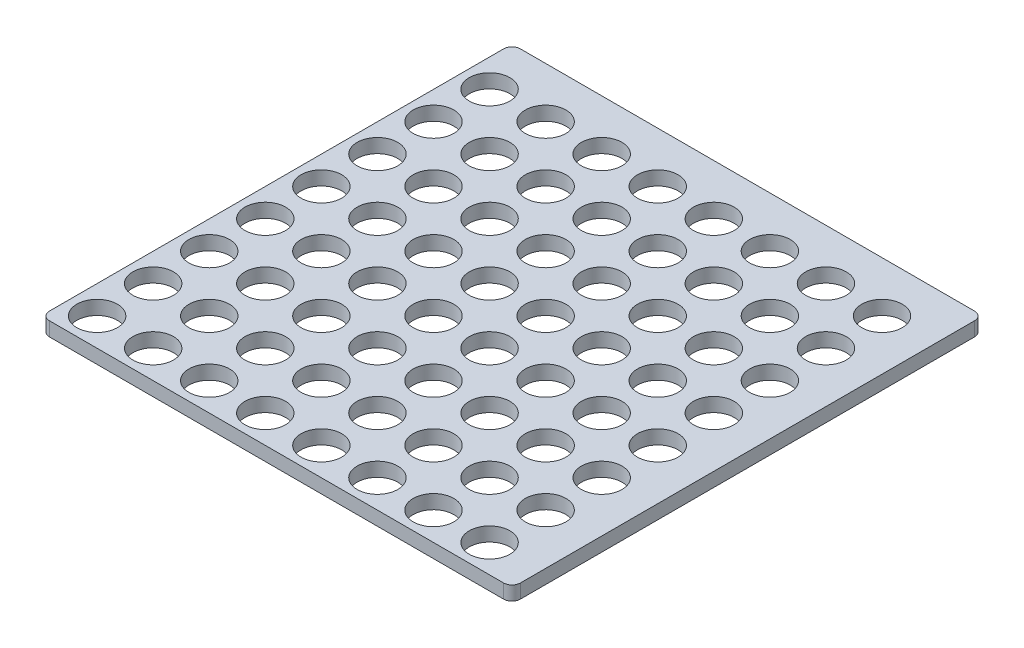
from build123d import *

# Parameters (mm, degrees)
SKETCH1_W              = 168
SKETCH1_H              = 168
BOSS_EXTRUDE1_DEPTH    = 5
FILLET1_R              = 3
M16X1_5_TAPPED_HOLE1_D = 14.5
LPATTERN1_COUNT        = 8
LPATTERN1_PITCH        = 20
LPATTERN2_COUNT        = 8
LPATTERN2_PITCH        = 20
LPATTERN2_COPY_1_D     = 14.5
LPATTERN2_COPY_2_D     = 14.5
LPATTERN2_COPY_3_D     = 14.5
LPATTERN2_COPY_4_D     = 14.5
LPATTERN2_COPY_5_D     = 14.5
LPATTERN2_COPY_6_D     = 14.5
LPATTERN2_COPY_7_D     = 14.5
LPATTERN2_COPY_8_D     = 14.5
LPATTERN2_COPY_9_D     = 14.5
LPATTERN2_COPY_10_D    = 14.5
LPATTERN2_COPY_11_D    = 14.5
LPATTERN2_COPY_12_D    = 14.5
LPATTERN2_COPY_13_D    = 14.5
LPATTERN2_COPY_14_D    = 14.5
LPATTERN2_COPY_15_D    = 14.5
LPATTERN2_COPY_16_D    = 14.5
LPATTERN2_COPY_17_D    = 14.5
LPATTERN2_COPY_18_D    = 14.5
LPATTERN2_COPY_19_D    = 14.5
LPATTERN2_COPY_20_D    = 14.5
LPATTERN2_COPY_21_D    = 14.5
LPATTERN2_COPY_22_D    = 14.5
LPATTERN2_COPY_23_D    = 14.5
LPATTERN2_COPY_24_D    = 14.5
LPATTERN2_COPY_25_D    = 14.5
LPATTERN2_COPY_26_D    = 14.5
LPATTERN2_COPY_27_D    = 14.5
LPATTERN2_COPY_28_D    = 14.5
LPATTERN2_COPY_29_D    = 14.5
LPATTERN2_COPY_30_D    = 14.5
LPATTERN2_COPY_31_D    = 14.5
LPATTERN2_COPY_32_D    = 14.5
LPATTERN2_COPY_33_D    = 14.5
LPATTERN2_COPY_34_D    = 14.5
LPATTERN2_COPY_35_D    = 14.5
LPATTERN2_COPY_36_D    = 14.5
LPATTERN2_COPY_37_D    = 14.5
LPATTERN2_COPY_38_D    = 14.5
LPATTERN2_COPY_39_D    = 14.5
LPATTERN2_COPY_40_D    = 14.5
LPATTERN2_COPY_41_D    = 14.5
LPATTERN2_COPY_42_D    = 14.5
LPATTERN2_COPY_43_D    = 14.5
LPATTERN2_COPY_44_D    = 14.5
LPATTERN2_COPY_45_D    = 14.5
LPATTERN2_COPY_46_D    = 14.5
LPATTERN2_COPY_47_D    = 14.5
LPATTERN2_COPY_48_D    = 14.5
LPATTERN2_COPY_49_D    = 14.5


with BuildPart() as part:
    # Sketch1 → Boss-Extrude1 (new body)
    with BuildSketch(Plane(origin=(0, 0, 0), x_dir=(1, 0, 0), z_dir=(0, 1, 0))):
        Rectangle(SKETCH1_W, SKETCH1_H)
    extrude(amount=BOSS_EXTRUDE1_DEPTH)

    # Fillet1
    fillet1_edges = [part.edges().sort_by_distance(p)[0] for p in [
        (84, 2.5, 84),
        (-84, 2.5, 84),
        (-84, 2.5, -84),
        (84, 2.5, -84),
    ]]
    fillet(fillet1_edges, radius=FILLET1_R)

    # M16x1.5 Tapped Hole1 (through all)
    with Locations(Plane(origin=(-74, 0, -65.997503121), x_dir=(0, 0, -1), z_dir=(0, -1, 0))):
        with Locations((0, 0)):
            m16x1_5_tapped_hole1 = Hole(M16X1_5_TAPPED_HOLE1_D / 2)

    # LPattern1: M16x1.5 Tapped Hole1 ×8
    with Locations(*[(i * LPATTERN1_PITCH, 0, 0) for i in range(1, LPATTERN1_COUNT)]):
        add(m16x1_5_tapped_hole1, mode=Mode.SUBTRACT)

    # LPattern2: M16x1.5 Tapped Hole1 ×8
    with Locations(*[(0, 0, i * LPATTERN2_PITCH) for i in range(1, LPATTERN2_COUNT)]):
        add(m16x1_5_tapped_hole1, mode=Mode.SUBTRACT)

    # LPattern2 copy 1 (through all)
    with Locations(Plane(origin=(-54, 0, -45.997503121), x_dir=(0, 0, -1), z_dir=(0, -1, 0))):
        with Locations((0, 0)):
            Hole(LPATTERN2_COPY_1_D / 2)

    # LPattern2 copy 2 (through all)
    with Locations(Plane(origin=(-54, 0, -25.997503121), x_dir=(0, 0, -1), z_dir=(0, -1, 0))):
        with Locations((0, 0)):
            Hole(LPATTERN2_COPY_2_D / 2)

    # LPattern2 copy 3 (through all)
    with Locations(Plane(origin=(-54, 0, -5.997503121), x_dir=(0, 0, -1), z_dir=(0, -1, 0))):
        with Locations((0, 0)):
            Hole(LPATTERN2_COPY_3_D / 2)

    # LPattern2 copy 4 (through all)
    with Locations(Plane(origin=(-54, 0, 14.002496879), x_dir=(0, 0, -1), z_dir=(0, -1, 0))):
        with Locations((0, 0)):
            Hole(LPATTERN2_COPY_4_D / 2)

    # LPattern2 copy 5 (through all)
    with Locations(Plane(origin=(-54, 0, 34.002496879), x_dir=(0, 0, -1), z_dir=(0, -1, 0))):
        with Locations((0, 0)):
            Hole(LPATTERN2_COPY_5_D / 2)

    # LPattern2 copy 6 (through all)
    with Locations(Plane(origin=(-54, 0, 54.002496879), x_dir=(0, 0, -1), z_dir=(0, -1, 0))):
        with Locations((0, 0)):
            Hole(LPATTERN2_COPY_6_D / 2)

    # LPattern2 copy 7 (through all)
    with Locations(Plane(origin=(-54, 0, 74.002496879), x_dir=(0, 0, -1), z_dir=(0, -1, 0))):
        with Locations((0, 0)):
            Hole(LPATTERN2_COPY_7_D / 2)

    # LPattern2 copy 8 (through all)
    with Locations(Plane(origin=(-34, 0, -45.997503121), x_dir=(0, 0, -1), z_dir=(0, -1, 0))):
        with Locations((0, 0)):
            Hole(LPATTERN2_COPY_8_D / 2)

    # LPattern2 copy 9 (through all)
    with Locations(Plane(origin=(-34, 0, -25.997503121), x_dir=(0, 0, -1), z_dir=(0, -1, 0))):
        with Locations((0, 0)):
            Hole(LPATTERN2_COPY_9_D / 2)

    # LPattern2 copy 10 (through all)
    with Locations(Plane(origin=(-34, 0, -5.997503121), x_dir=(0, 0, -1), z_dir=(0, -1, 0))):
        with Locations((0, 0)):
            Hole(LPATTERN2_COPY_10_D / 2)

    # LPattern2 copy 11 (through all)
    with Locations(Plane(origin=(-34, 0, 14.002496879), x_dir=(0, 0, -1), z_dir=(0, -1, 0))):
        with Locations((0, 0)):
            Hole(LPATTERN2_COPY_11_D / 2)

    # LPattern2 copy 12 (through all)
    with Locations(Plane(origin=(-34, 0, 34.002496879), x_dir=(0, 0, -1), z_dir=(0, -1, 0))):
        with Locations((0, 0)):
            Hole(LPATTERN2_COPY_12_D / 2)

    # LPattern2 copy 13 (through all)
    with Locations(Plane(origin=(-34, 0, 54.002496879), x_dir=(0, 0, -1), z_dir=(0, -1, 0))):
        with Locations((0, 0)):
            Hole(LPATTERN2_COPY_13_D / 2)

    # LPattern2 copy 14 (through all)
    with Locations(Plane(origin=(-34, 0, 74.002496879), x_dir=(0, 0, -1), z_dir=(0, -1, 0))):
        with Locations((0, 0)):
            Hole(LPATTERN2_COPY_14_D / 2)

    # LPattern2 copy 15 (through all)
    with Locations(Plane(origin=(-14, 0, -45.997503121), x_dir=(0, 0, -1), z_dir=(0, -1, 0))):
        with Locations((0, 0)):
            Hole(LPATTERN2_COPY_15_D / 2)

    # LPattern2 copy 16 (through all)
    with Locations(Plane(origin=(-14, 0, -25.997503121), x_dir=(0, 0, -1), z_dir=(0, -1, 0))):
        with Locations((0, 0)):
            Hole(LPATTERN2_COPY_16_D / 2)

    # LPattern2 copy 17 (through all)
    with Locations(Plane(origin=(-14, 0, -5.997503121), x_dir=(0, 0, -1), z_dir=(0, -1, 0))):
        with Locations((0, 0)):
            Hole(LPATTERN2_COPY_17_D / 2)

    # LPattern2 copy 18 (through all)
    with Locations(Plane(origin=(-14, 0, 14.002496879), x_dir=(0, 0, -1), z_dir=(0, -1, 0))):
        with Locations((0, 0)):
            Hole(LPATTERN2_COPY_18_D / 2)

    # LPattern2 copy 19 (through all)
    with Locations(Plane(origin=(-14, 0, 34.002496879), x_dir=(0, 0, -1), z_dir=(0, -1, 0))):
        with Locations((0, 0)):
            Hole(LPATTERN2_COPY_19_D / 2)

    # LPattern2 copy 20 (through all)
    with Locations(Plane(origin=(-14, 0, 54.002496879), x_dir=(0, 0, -1), z_dir=(0, -1, 0))):
        with Locations((0, 0)):
            Hole(LPATTERN2_COPY_20_D / 2)

    # LPattern2 copy 21 (through all)
    with Locations(Plane(origin=(-14, 0, 74.002496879), x_dir=(0, 0, -1), z_dir=(0, -1, 0))):
        with Locations((0, 0)):
            Hole(LPATTERN2_COPY_21_D / 2)

    # LPattern2 copy 22 (through all)
    with Locations(Plane(origin=(6, 0, -45.997503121), x_dir=(0, 0, -1), z_dir=(0, -1, 0))):
        with Locations((0, 0)):
            Hole(LPATTERN2_COPY_22_D / 2)

    # LPattern2 copy 23 (through all)
    with Locations(Plane(origin=(6, 0, -25.997503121), x_dir=(0, 0, -1), z_dir=(0, -1, 0))):
        with Locations((0, 0)):
            Hole(LPATTERN2_COPY_23_D / 2)

    # LPattern2 copy 24 (through all)
    with Locations(Plane(origin=(6, 0, -5.997503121), x_dir=(0, 0, -1), z_dir=(0, -1, 0))):
        with Locations((0, 0)):
            Hole(LPATTERN2_COPY_24_D / 2)

    # LPattern2 copy 25 (through all)
    with Locations(Plane(origin=(6, 0, 14.002496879), x_dir=(0, 0, -1), z_dir=(0, -1, 0))):
        with Locations((0, 0)):
            Hole(LPATTERN2_COPY_25_D / 2)

    # LPattern2 copy 26 (through all)
    with Locations(Plane(origin=(6, 0, 34.002496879), x_dir=(0, 0, -1), z_dir=(0, -1, 0))):
        with Locations((0, 0)):
            Hole(LPATTERN2_COPY_26_D / 2)

    # LPattern2 copy 27 (through all)
    with Locations(Plane(origin=(6, 0, 54.002496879), x_dir=(0, 0, -1), z_dir=(0, -1, 0))):
        with Locations((0, 0)):
            Hole(LPATTERN2_COPY_27_D / 2)

    # LPattern2 copy 28 (through all)
    with Locations(Plane(origin=(6, 0, 74.002496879), x_dir=(0, 0, -1), z_dir=(0, -1, 0))):
        with Locations((0, 0)):
            Hole(LPATTERN2_COPY_28_D / 2)

    # LPattern2 copy 29 (through all)
    with Locations(Plane(origin=(26, 0, -45.997503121), x_dir=(0, 0, -1), z_dir=(0, -1, 0))):
        with Locations((0, 0)):
            Hole(LPATTERN2_COPY_29_D / 2)

    # LPattern2 copy 30 (through all)
    with Locations(Plane(origin=(26, 0, -25.997503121), x_dir=(0, 0, -1), z_dir=(0, -1, 0))):
        with Locations((0, 0)):
            Hole(LPATTERN2_COPY_30_D / 2)

    # LPattern2 copy 31 (through all)
    with Locations(Plane(origin=(26, 0, -5.997503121), x_dir=(0, 0, -1), z_dir=(0, -1, 0))):
        with Locations((0, 0)):
            Hole(LPATTERN2_COPY_31_D / 2)

    # LPattern2 copy 32 (through all)
    with Locations(Plane(origin=(26, 0, 14.002496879), x_dir=(0, 0, -1), z_dir=(0, -1, 0))):
        with Locations((0, 0)):
            Hole(LPATTERN2_COPY_32_D / 2)

    # LPattern2 copy 33 (through all)
    with Locations(Plane(origin=(26, 0, 34.002496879), x_dir=(0, 0, -1), z_dir=(0, -1, 0))):
        with Locations((0, 0)):
            Hole(LPATTERN2_COPY_33_D / 2)

    # LPattern2 copy 34 (through all)
    with Locations(Plane(origin=(26, 0, 54.002496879), x_dir=(0, 0, -1), z_dir=(0, -1, 0))):
        with Locations((0, 0)):
            Hole(LPATTERN2_COPY_34_D / 2)

    # LPattern2 copy 35 (through all)
    with Locations(Plane(origin=(26, 0, 74.002496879), x_dir=(0, 0, -1), z_dir=(0, -1, 0))):
        with Locations((0, 0)):
            Hole(LPATTERN2_COPY_35_D / 2)

    # LPattern2 copy 36 (through all)
    with Locations(Plane(origin=(46, 0, -45.997503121), x_dir=(0, 0, -1), z_dir=(0, -1, 0))):
        with Locations((0, 0)):
            Hole(LPATTERN2_COPY_36_D / 2)

    # LPattern2 copy 37 (through all)
    with Locations(Plane(origin=(46, 0, -25.997503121), x_dir=(0, 0, -1), z_dir=(0, -1, 0))):
        with Locations((0, 0)):
            Hole(LPATTERN2_COPY_37_D / 2)

    # LPattern2 copy 38 (through all)
    with Locations(Plane(origin=(46, 0, -5.997503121), x_dir=(0, 0, -1), z_dir=(0, -1, 0))):
        with Locations((0, 0)):
            Hole(LPATTERN2_COPY_38_D / 2)

    # LPattern2 copy 39 (through all)
    with Locations(Plane(origin=(46, 0, 14.002496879), x_dir=(0, 0, -1), z_dir=(0, -1, 0))):
        with Locations((0, 0)):
            Hole(LPATTERN2_COPY_39_D / 2)

    # LPattern2 copy 40 (through all)
    with Locations(Plane(origin=(46, 0, 34.002496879), x_dir=(0, 0, -1), z_dir=(0, -1, 0))):
        with Locations((0, 0)):
            Hole(LPATTERN2_COPY_40_D / 2)

    # LPattern2 copy 41 (through all)
    with Locations(Plane(origin=(46, 0, 54.002496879), x_dir=(0, 0, -1), z_dir=(0, -1, 0))):
        with Locations((0, 0)):
            Hole(LPATTERN2_COPY_41_D / 2)

    # LPattern2 copy 42 (through all)
    with Locations(Plane(origin=(46, 0, 74.002496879), x_dir=(0, 0, -1), z_dir=(0, -1, 0))):
        with Locations((0, 0)):
            Hole(LPATTERN2_COPY_42_D / 2)

    # LPattern2 copy 43 (through all)
    with Locations(Plane(origin=(66, 0, -45.997503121), x_dir=(0, 0, -1), z_dir=(0, -1, 0))):
        with Locations((0, 0)):
            Hole(LPATTERN2_COPY_43_D / 2)

    # LPattern2 copy 44 (through all)
    with Locations(Plane(origin=(66, 0, -25.997503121), x_dir=(0, 0, -1), z_dir=(0, -1, 0))):
        with Locations((0, 0)):
            Hole(LPATTERN2_COPY_44_D / 2)

    # LPattern2 copy 45 (through all)
    with Locations(Plane(origin=(66, 0, -5.997503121), x_dir=(0, 0, -1), z_dir=(0, -1, 0))):
        with Locations((0, 0)):
            Hole(LPATTERN2_COPY_45_D / 2)

    # LPattern2 copy 46 (through all)
    with Locations(Plane(origin=(66, 0, 14.002496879), x_dir=(0, 0, -1), z_dir=(0, -1, 0))):
        with Locations((0, 0)):
            Hole(LPATTERN2_COPY_46_D / 2)

    # LPattern2 copy 47 (through all)
    with Locations(Plane(origin=(66, 0, 34.002496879), x_dir=(0, 0, -1), z_dir=(0, -1, 0))):
        with Locations((0, 0)):
            Hole(LPATTERN2_COPY_47_D / 2)

    # LPattern2 copy 48 (through all)
    with Locations(Plane(origin=(66, 0, 54.002496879), x_dir=(0, 0, -1), z_dir=(0, -1, 0))):
        with Locations((0, 0)):
            Hole(LPATTERN2_COPY_48_D / 2)

    # LPattern2 copy 49 (through all)
    with Locations(Plane(origin=(66, 0, 74.002496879), x_dir=(0, 0, -1), z_dir=(0, -1, 0))):
        with Locations((0, 0)):
            Hole(LPATTERN2_COPY_49_D / 2)


solid = part.part
